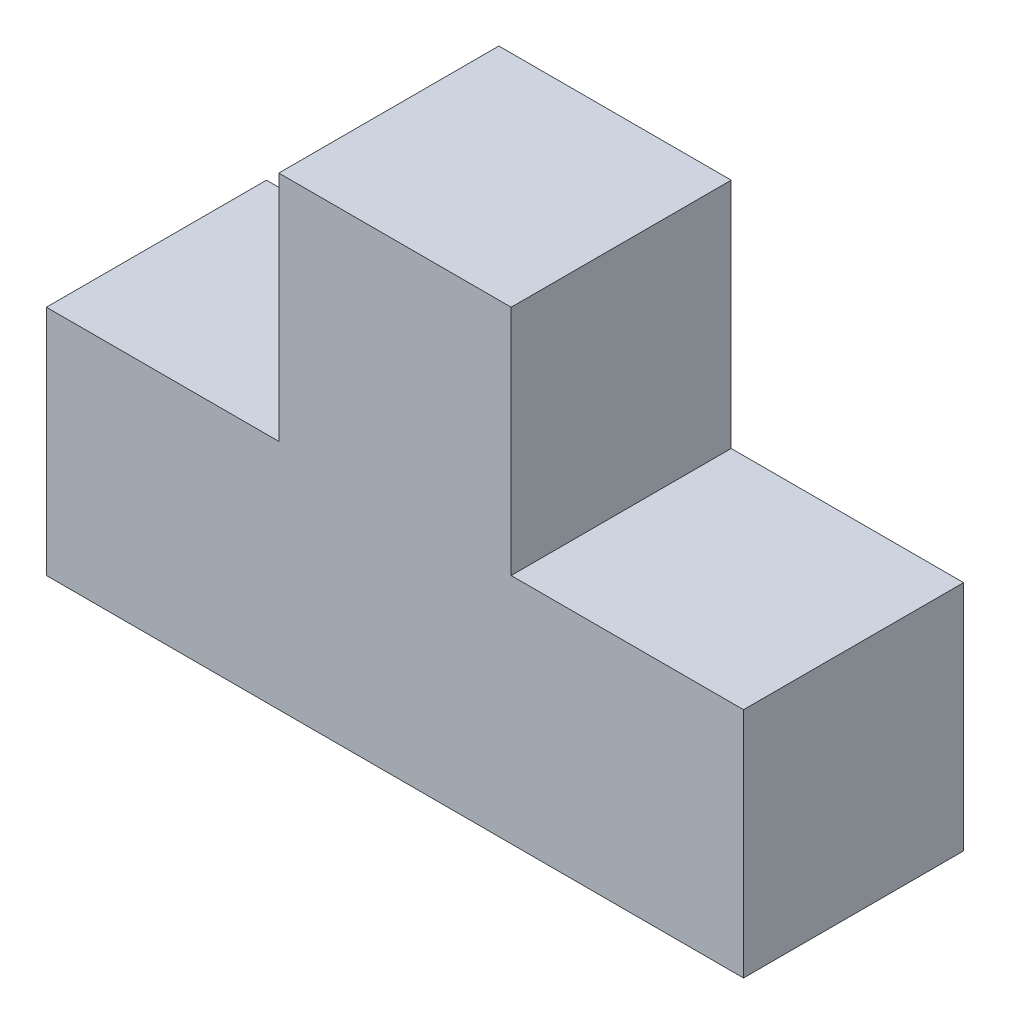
from build123d import *

# Parameters (mm, degrees)
EXTRUDE1_DEPTH = 30.48


with BuildPart() as part:
    # Sketch2 → Extrude1 (new body)
    with BuildSketch(Plane.XY):
        Polygon((35.959814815, 32.712848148), (35.959814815, 64.897940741), (68.144907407, 64.897940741), (68.144907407, 97.083033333), (100.33, 97.083033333), (100.33, 64.897940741), (132.515092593, 64.897940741), (132.515092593, 32.712848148), align=None)
    extrude(amount=-EXTRUDE1_DEPTH)


solid = part.part
